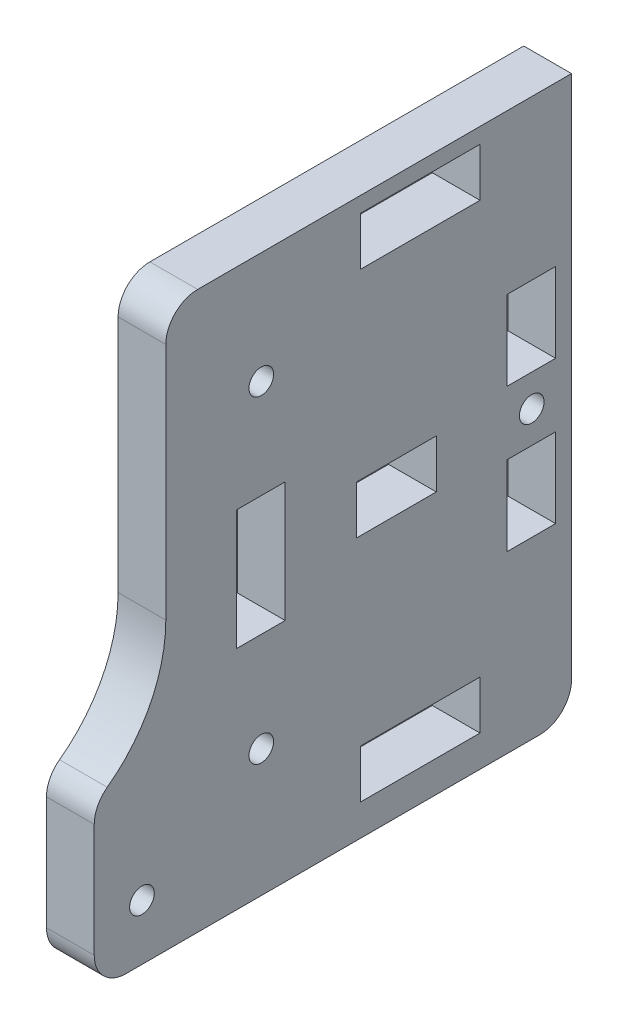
from build123d import *

# Parameters (mm, degrees)
EXTRUDE_1_DEPTH     = 6
FILLET_1_R          = 4
SKETCH_2_R          = 1.55
CUT_EXTRUDE_1_DEPTH = 93.3904757
SKETCH_3_W          = 6.1
SKETCH_3_H          = 10
SKETCH_3_H_2        = 15.1
SKETCH_3_W_2        = 10
SKETCH_3_H_3        = 6.1
SKETCH_3_W_3        = 15
CUT_EXTRUDE_2_DEPTH = 93.3904757


with BuildPart() as part:
    # Sketch 1 → Extrude 1 (new body)
    with BuildSketch(Plane(origin=(0, 0, 0), x_dir=(0, 0, -1), z_dir=(1, 0, 0))):
        with BuildLine():
            Line((0, 0), (-60, 0))
            Line((-60, 0), (-60, 20.411542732))
            ThreePointArc((-60, 20.411542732), (-53.411542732, 27), (-51, 36))
            Line((-51, 36), (-51, 70))
            Line((-51, 70), (0, 70))
            Line((0, 70), (0, 0))
        make_face()
    extrude(amount=EXTRUDE_1_DEPTH)

    # Fillet 1
    fillet_1_edges = [part.edges().sort_by_distance(p)[0] for p in [
        (3, 0, 0),
        (3, 0, 60),
        (3, 20.411542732, 60),
        (3, 70, 51),
    ]]
    fillet(fillet_1_edges, radius=FILLET_1_R)

    # Sketch 2 → Cut-Extrude 1 (cut, through all)
    with BuildSketch(Plane(origin=(6, 0, 0), x_dir=(0, 0, -1), z_dir=(1, 0, 0))):
        with Locations(Location((-39, 16, 0), (0, 0, 180))):
            Circle(SKETCH_2_R)
        with Locations((-5, 36)):
            Circle(SKETCH_2_R)
        with Locations((-54, 7)):
            Circle(SKETCH_2_R)
        with Locations((-39, 56)):
            Circle(SKETCH_2_R)
    extrude(amount=-CUT_EXTRUDE_1_DEPTH, mode=Mode.SUBTRACT)

    # Sketch 3 → Cut-Extrude 2 (cut, through all)
    with BuildSketch(Plane(origin=(6, 0, 0), x_dir=(0, 0, -1), z_dir=(1, 0, 0))):
        with Locations((-5.05, 27)):
            Rectangle(SKETCH_3_W, SKETCH_3_H)
        with Locations((-5.05, 45)):
            Rectangle(SKETCH_3_W, SKETCH_3_H)
        with Locations((-39.05, 36)):
            Rectangle(SKETCH_3_W, SKETCH_3_H_2)
        with Locations((-22, 36)):
            Rectangle(SKETCH_3_W_2, SKETCH_3_H_3)
        with Locations((-19, 65)):
            Rectangle(SKETCH_3_W_3, SKETCH_3_H_3)
        with Locations((-19, 7)):
            Rectangle(SKETCH_3_W_3, SKETCH_3_H_3)
    extrude(amount=-CUT_EXTRUDE_2_DEPTH, mode=Mode.SUBTRACT)


solid = part.part
